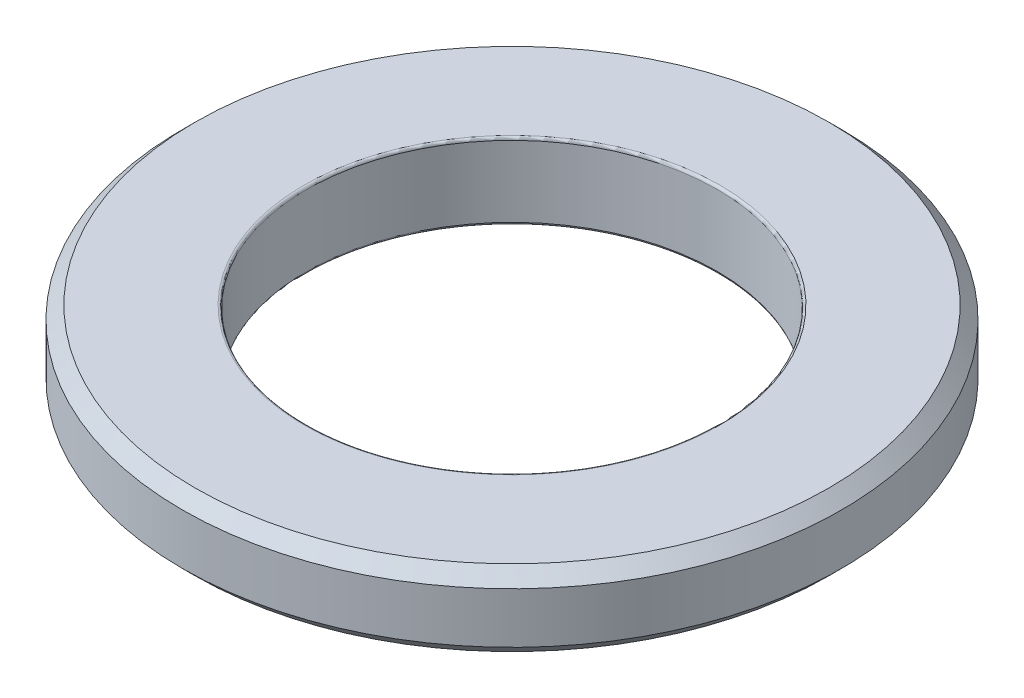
from build123d import *

# Parameters (mm, degrees)
ESQUISSE1_W     = 4.9
ESQUISSE1_H     = 3
CONG_1_R        = 0.1
CHANFREIN1_SIZE = 0.5


with BuildPart() as part:
    # Esquisse1 → R_volution1 (revolve)
    with BuildSketch(Plane.XY, mode=Mode.PRIVATE) as r_volution1_sk:
        with Locations((-10.55, 1.5)):
            Rectangle(ESQUISSE1_W, ESQUISSE1_H)
    revolve(r_volution1_sk.sketch.rotate(Axis((0, 0, 0), (0, 1, 0)), 270), axis=Axis((0, 0, 0), (0, 1, 0)))

    # Cong_1
    cong_1_edges = [part.edges().sort_by_distance(p)[0] for p in [
        (0, 3, 8.1),
        (0, 0, 8.1),
    ]]
    fillet(cong_1_edges, radius=CONG_1_R)

    # Chanfrein1
    chanfrein1_edges = [part.edges().sort_by_distance(p)[0] for p in [
        (0, 3, 13),
        (0, 0, 13),
    ]]
    chamfer(chanfrein1_edges, length=CHANFREIN1_SIZE)


solid = part.part
